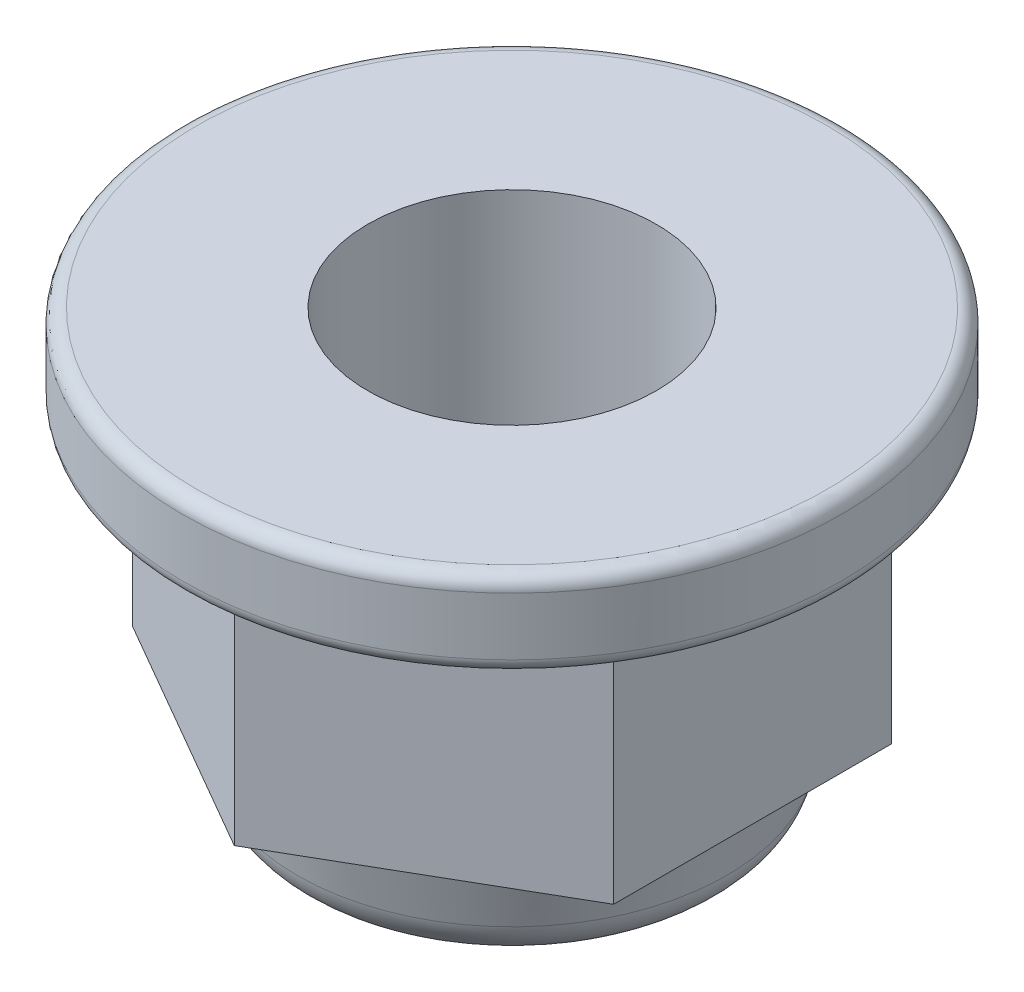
ISO-10303-21;
HEADER;
FILE_DESCRIPTION(('STEP AP214'),'2;1');
FILE_NAME('part.step','',(''),(''),'','','');
FILE_SCHEMA(('AUTOMOTIVE_DESIGN { 1 0 10303 214 1 1 1 1 }'));
ENDSEC;
DATA;
#1=APPLICATION_CONTEXT('core data for automotive mechanical design processes');
#2=APPLICATION_PROTOCOL_DEFINITION('international standard','automotive_design',2000,#1);
#3=PRODUCT_CONTEXT('',#1,'mechanical');
#4=PRODUCT('Part','Part','',(#3));
#5=PRODUCT_RELATED_PRODUCT_CATEGORY('part','',(#4));
#6=PRODUCT_DEFINITION_FORMATION('','',#4);
#7=PRODUCT_DEFINITION_CONTEXT('part definition',#1,'design');
#8=PRODUCT_DEFINITION('design','',#6,#7);
#9=PRODUCT_DEFINITION_SHAPE('','',#8);
#10=(LENGTH_UNIT() NAMED_UNIT(*) SI_UNIT(.MILLI.,.METRE.));
#11=(NAMED_UNIT(*) PLANE_ANGLE_UNIT() SI_UNIT($,.RADIAN.));
#12=(NAMED_UNIT(*) SI_UNIT($,.STERADIAN.) SOLID_ANGLE_UNIT());
#13=UNCERTAINTY_MEASURE_WITH_UNIT(LENGTH_MEASURE(1.E-05),#10,'distance_accuracy_value','');
#14=(GEOMETRIC_REPRESENTATION_CONTEXT(3) GLOBAL_UNCERTAINTY_ASSIGNED_CONTEXT((#13)) GLOBAL_UNIT_ASSIGNED_CONTEXT((#10,
#11,#12)) REPRESENTATION_CONTEXT('',''));
#15=CARTESIAN_POINT('',(0.,0.,0.));
#16=DIRECTION('',(0.,0.,1.));
#17=DIRECTION('',(1.,0.,0.));
#18=AXIS2_PLACEMENT_3D('',#15,#16,#17);
#19=CARTESIAN_POINT('',(0.,0.,-5.77350269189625));
#20=DIRECTION('',(0.,1.,0.));
#21=DIRECTION('',(-1.,0.,0.));
#22=AXIS2_PLACEMENT_3D('',#19,#20,#21);
#23=PLANE('',#22);
#24=DIRECTION('',(0.,0.,1.));
#25=VECTOR('',#24,1.);
#26=CARTESIAN_POINT('',(4.99999999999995,0.,2.88675134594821));
#27=LINE('',#26,#25);
#28=CARTESIAN_POINT('',(4.99999999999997,0.,-2.88675134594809));
#29=VERTEX_POINT('',#28);
#30=CARTESIAN_POINT('',(4.99999999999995,0.,2.88675134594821));
#31=VERTEX_POINT('',#30);
#32=EDGE_CURVE('E100',#29,#31,#27,.T.);
#33=ORIENTED_EDGE('',*,*,#32,.T.);
#34=DIRECTION('',(-0.866025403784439,0.,0.5));
#35=VECTOR('',#34,1.);
#36=CARTESIAN_POINT('',(0.,0.,5.77350269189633));
#37=LINE('',#36,#35);
#38=CARTESIAN_POINT('',(0.,0.,5.77350269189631));
#39=VERTEX_POINT('',#38);
#40=EDGE_CURVE('E106',#31,#39,#37,.T.);
#41=ORIENTED_EDGE('',*,*,#40,.T.);
#42=DIRECTION('',(-0.866025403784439,0.,-0.5));
#43=VECTOR('',#42,1.);
#44=CARTESIAN_POINT('',(-5.,0.,2.88675134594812));
#45=LINE('',#44,#43);
#46=CARTESIAN_POINT('',(-5.00000000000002,0.,2.88675134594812));
#47=VERTEX_POINT('',#46);
#48=EDGE_CURVE('E178',#39,#47,#45,.T.);
#49=ORIENTED_EDGE('',*,*,#48,.T.);
#50=DIRECTION('',(0.,0.,-1.));
#51=VECTOR('',#50,1.);
#52=CARTESIAN_POINT('',(-5.00000000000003,0.,-2.88675134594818));
#53=LINE('',#52,#51);
#54=CARTESIAN_POINT('',(-5.00000000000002,0.,-2.88675134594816));
#55=VERTEX_POINT('',#54);
#56=EDGE_CURVE('E173',#47,#55,#53,.T.);
#57=ORIENTED_EDGE('',*,*,#56,.T.);
#58=DIRECTION('',(0.866025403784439,0.,-0.499999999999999));
#59=VECTOR('',#58,1.);
#60=CARTESIAN_POINT('',(0.,0.,-5.77350269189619));
#61=LINE('',#60,#59);
#62=CARTESIAN_POINT('',(0.,0.,-5.77350269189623));
#63=VERTEX_POINT('',#62);
#64=EDGE_CURVE('E168',#55,#63,#61,.T.);
#65=ORIENTED_EDGE('',*,*,#64,.T.);
#66=DIRECTION('',(0.866025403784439,0.,0.5));
#67=VECTOR('',#66,1.);
#68=CARTESIAN_POINT('',(4.99999999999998,0.,-2.88675134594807));
#69=LINE('',#68,#67);
#70=EDGE_CURVE('E163',#63,#29,#69,.T.);
#71=ORIENTED_EDGE('',*,*,#70,.T.);
#72=EDGE_LOOP('',(#33,#41,#49,#57,#65,#71));
#73=FACE_BOUND('',#72,.T.);
#74=CARTESIAN_POINT('',(0.,0.,0.));
#75=DIRECTION('',(0.,-1.,0.));
#76=DIRECTION('',(0.,0.,1.));
#77=AXIS2_PLACEMENT_3D('',#74,#75,#76);
#78=CIRCLE('',#77,4.86396078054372);
#79=CARTESIAN_POINT('',(0.,0.,-4.86396078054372));
#80=VERTEX_POINT('',#79);
#81=CARTESIAN_POINT('',(0.,0.,4.86396078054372));
#82=VERTEX_POINT('',#81);
#83=EDGE_CURVE('E98',#80,#82,#78,.F.);
#84=ORIENTED_EDGE('',*,*,#83,.T.);
#85=CARTESIAN_POINT('',(0.,0.,0.));
#86=DIRECTION('',(0.,-1.,0.));
#87=DIRECTION('',(0.,0.,-1.));
#88=AXIS2_PLACEMENT_3D('',#85,#86,#87);
#89=CIRCLE('',#88,4.86396078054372);
#90=EDGE_CURVE('E93',#82,#80,#89,.F.);
#91=ORIENTED_EDGE('',*,*,#90,.T.);
#92=EDGE_LOOP('',(#84,#91));
#93=FACE_BOUND('',#92,.T.);
#94=ADVANCED_FACE('F17',(#73,#93),#23,.F.);
#95=CARTESIAN_POINT('',(0.,5.,5.77350269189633));
#96=DIRECTION('',(-0.5,0.,-0.866025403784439));
#97=DIRECTION('',(-0.866025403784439,0.,0.5));
#98=AXIS2_PLACEMENT_3D('',#95,#96,#97);
#99=PLANE('',#98);
#100=DIRECTION('',(0.,1.,0.));
#101=VECTOR('',#100,1.);
#102=CARTESIAN_POINT('',(4.99999999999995,5.,2.88675134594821));
#103=LINE('',#102,#101);
#104=CARTESIAN_POINT('',(4.99999999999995,5.,2.8867513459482));
#105=VERTEX_POINT('',#104);
#106=EDGE_CURVE('E161',#31,#105,#103,.T.);
#107=ORIENTED_EDGE('',*,*,#106,.T.);
#108=DIRECTION('',(-0.866025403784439,0.,0.499999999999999));
#109=VECTOR('',#108,1.);
#110=CARTESIAN_POINT('',(4.99999999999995,5.,2.88675134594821));
#111=LINE('',#110,#109);
#112=CARTESIAN_POINT('',(0.,5.,5.77350269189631));
#113=VERTEX_POINT('',#112);
#114=EDGE_CURVE('E103',#105,#113,#111,.T.);
#115=ORIENTED_EDGE('',*,*,#114,.T.);
#116=DIRECTION('',(0.,1.,0.));
#117=VECTOR('',#116,1.);
#118=CARTESIAN_POINT('',(0.,5.,5.77350269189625));
#119=LINE('',#118,#117);
#120=EDGE_CURVE('E179',#113,#39,#119,.F.);
#121=ORIENTED_EDGE('',*,*,#120,.T.);
#122=ORIENTED_EDGE('',*,*,#40,.F.);
#123=EDGE_LOOP('',(#107,#115,#121,#122));
#124=FACE_BOUND('',#123,.T.);
#125=ADVANCED_FACE('F187',(#124),#99,.F.);
#126=CARTESIAN_POINT('',(-5.,5.,2.88675134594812));
#127=DIRECTION('',(0.5,0.,-0.866025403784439));
#128=DIRECTION('',(-0.866025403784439,0.,-0.5));
#129=AXIS2_PLACEMENT_3D('',#126,#127,#128);
#130=PLANE('',#129);
#131=ORIENTED_EDGE('',*,*,#120,.F.);
#132=DIRECTION('',(-0.86602540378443,0.,-0.500000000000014));
#133=VECTOR('',#132,1.);
#134=CARTESIAN_POINT('',(0.,5.,5.77350269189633));
#135=LINE('',#134,#133);
#136=CARTESIAN_POINT('',(-5.00000000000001,5.,2.88675134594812));
#137=VERTEX_POINT('',#136);
#138=EDGE_CURVE('E200',#113,#137,#135,.T.);
#139=ORIENTED_EDGE('',*,*,#138,.T.);
#140=DIRECTION('',(0.,1.,0.));
#141=VECTOR('',#140,1.);
#142=CARTESIAN_POINT('',(-5.00000000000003,5.,2.88675134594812));
#143=LINE('',#142,#141);
#144=EDGE_CURVE('E175',#137,#47,#143,.F.);
#145=ORIENTED_EDGE('',*,*,#144,.T.);
#146=ORIENTED_EDGE('',*,*,#48,.F.);
#147=EDGE_LOOP('',(#131,#139,#145,#146));
#148=FACE_BOUND('',#147,.T.);
#149=ADVANCED_FACE('F424',(#148),#130,.F.);
#150=CARTESIAN_POINT('',(-5.00000000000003,5.,-2.88675134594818));
#151=DIRECTION('',(1.,0.,0.));
#152=DIRECTION('',(0.,0.,-1.));
#153=AXIS2_PLACEMENT_3D('',#150,#151,#152);
#154=PLANE('',#153);
#155=ORIENTED_EDGE('',*,*,#144,.F.);
#156=DIRECTION('',(0.,0.,1.));
#157=VECTOR('',#156,1.);
#158=CARTESIAN_POINT('',(-5.,5.,0.));
#159=LINE('',#158,#157);
#160=CARTESIAN_POINT('',(-5.00000000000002,5.,-2.88675134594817));
#161=VERTEX_POINT('',#160);
#162=EDGE_CURVE('E202',#137,#161,#159,.F.);
#163=ORIENTED_EDGE('',*,*,#162,.T.);
#164=DIRECTION('',(0.,1.,0.));
#165=VECTOR('',#164,1.);
#166=CARTESIAN_POINT('',(-5.,5.,-2.88675134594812));
#167=LINE('',#166,#165);
#168=EDGE_CURVE('E170',#161,#55,#167,.F.);
#169=ORIENTED_EDGE('',*,*,#168,.T.);
#170=ORIENTED_EDGE('',*,*,#56,.F.);
#171=EDGE_LOOP('',(#155,#163,#169,#170));
#172=FACE_BOUND('',#171,.T.);
#173=ADVANCED_FACE('F246',(#172),#154,.F.);
#174=CARTESIAN_POINT('',(0.,5.,-5.77350269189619));
#175=DIRECTION('',(0.499999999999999,0.,0.866025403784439));
#176=DIRECTION('',(0.866025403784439,0.,-0.499999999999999));
#177=AXIS2_PLACEMENT_3D('',#174,#175,#176);
#178=PLANE('',#177);
#179=ORIENTED_EDGE('',*,*,#168,.F.);
#180=DIRECTION('',(0.866025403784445,0.,-0.499999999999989));
#181=VECTOR('',#180,1.);
#182=CARTESIAN_POINT('',(-5.00000000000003,5.,-2.88675134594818));
#183=LINE('',#182,#181);
#184=CARTESIAN_POINT('',(0.,5.,-5.77350269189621));
#185=VERTEX_POINT('',#184);
#186=EDGE_CURVE('E242',#161,#185,#183,.T.);
#187=ORIENTED_EDGE('',*,*,#186,.T.);
#188=DIRECTION('',(0.,1.,0.));
#189=VECTOR('',#188,1.);
#190=CARTESIAN_POINT('',(0.,5.,-5.77350269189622));
#191=LINE('',#190,#189);
#192=EDGE_CURVE('E165',#185,#63,#191,.F.);
#193=ORIENTED_EDGE('',*,*,#192,.T.);
#194=ORIENTED_EDGE('',*,*,#64,.F.);
#195=EDGE_LOOP('',(#179,#187,#193,#194));
#196=FACE_BOUND('',#195,.T.);
#197=ADVANCED_FACE('F251',(#196),#178,.F.);
#198=CARTESIAN_POINT('',(4.99999999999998,5.,-2.88675134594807));
#199=DIRECTION('',(-0.5,0.,0.866025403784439));
#200=DIRECTION('',(0.866025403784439,0.,0.5));
#201=AXIS2_PLACEMENT_3D('',#198,#199,#200);
#202=PLANE('',#201);
#203=ORIENTED_EDGE('',*,*,#192,.F.);
#204=DIRECTION('',(0.866025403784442,0.,0.499999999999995));
#205=VECTOR('',#204,1.);
#206=CARTESIAN_POINT('',(0.,5.,-5.77350269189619));
#207=LINE('',#206,#205);
#208=CARTESIAN_POINT('',(4.99999999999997,5.,-2.88675134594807));
#209=VERTEX_POINT('',#208);
#210=EDGE_CURVE('E195',#185,#209,#207,.T.);
#211=ORIENTED_EDGE('',*,*,#210,.T.);
#212=DIRECTION('',(0.,1.,0.));
#213=VECTOR('',#212,1.);
#214=CARTESIAN_POINT('',(4.99999999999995,5.,-2.88675134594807));
#215=LINE('',#214,#213);
#216=EDGE_CURVE('E158',#209,#29,#215,.F.);
#217=ORIENTED_EDGE('',*,*,#216,.T.);
#218=ORIENTED_EDGE('',*,*,#70,.F.);
#219=EDGE_LOOP('',(#203,#211,#217,#218));
#220=FACE_BOUND('',#219,.T.);
#221=ADVANCED_FACE('F254',(#220),#202,.F.);
#222=CARTESIAN_POINT('',(4.99999999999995,5.,2.88675134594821));
#223=DIRECTION('',(-1.,0.,0.));
#224=DIRECTION('',(0.,0.,1.));
#225=AXIS2_PLACEMENT_3D('',#222,#223,#224);
#226=PLANE('',#225);
#227=ORIENTED_EDGE('',*,*,#216,.F.);
#228=DIRECTION('',(0.,0.,1.));
#229=VECTOR('',#228,1.);
#230=CARTESIAN_POINT('',(4.99999999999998,5.,0.));
#231=LINE('',#230,#229);
#232=EDGE_CURVE('E155',#209,#105,#231,.T.);
#233=ORIENTED_EDGE('',*,*,#232,.T.);
#234=ORIENTED_EDGE('',*,*,#106,.F.);
#235=ORIENTED_EDGE('',*,*,#32,.F.);
#236=EDGE_LOOP('',(#227,#233,#234,#235));
#237=FACE_BOUND('',#236,.T.);
#238=ADVANCED_FACE('F138',(#237),#226,.F.);
#239=CARTESIAN_POINT('',(0.,-0.200000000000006,0.));
#240=DIRECTION('',(0.,1.,0.));
#241=DIRECTION('',(0.,0.,1.));
#242=AXIS2_PLACEMENT_3D('',#239,#240,#241);
#243=TOROIDAL_SURFACE('',#242,4.86396078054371,0.2);
#244=CARTESIAN_POINT('',(0.,-0.160776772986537,0.));
#245=DIRECTION('',(0.,1.,0.));
#246=DIRECTION('',(0.,0.,1.));
#247=AXIS2_PLACEMENT_3D('',#244,#245,#246);
#248=CIRCLE('',#247,4.66784464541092);
#249=CARTESIAN_POINT('',(0.,-0.160776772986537,4.66784464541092));
#250=VERTEX_POINT('',#249);
#251=EDGE_CURVE('E151',#250,#250,#248,.F.);
#252=ORIENTED_EDGE('',*,*,#251,.F.);
#253=EDGE_LOOP('',(#252));
#254=FACE_BOUND('',#253,.T.);
#255=ORIENTED_EDGE('',*,*,#83,.F.);
#256=ORIENTED_EDGE('',*,*,#90,.F.);
#257=EDGE_LOOP('',(#255,#256));
#258=FACE_BOUND('',#257,.T.);
#259=ADVANCED_FACE('F97',(#254,#258),#243,.F.);
#260=CARTESIAN_POINT('',(0.,5.,0.));
#261=DIRECTION('',(0.,1.,0.));
#262=DIRECTION('',(-1.,0.,0.));
#263=AXIS2_PLACEMENT_3D('',#260,#261,#262);
#264=PLANE('',#263);
#265=ORIENTED_EDGE('',*,*,#210,.F.);
#266=ORIENTED_EDGE('',*,*,#186,.F.);
#267=ORIENTED_EDGE('',*,*,#162,.F.);
#268=ORIENTED_EDGE('',*,*,#138,.F.);
#269=ORIENTED_EDGE('',*,*,#114,.F.);
#270=ORIENTED_EDGE('',*,*,#232,.F.);
#271=EDGE_LOOP('',(#265,#266,#267,#268,#269,#270));
#272=FACE_BOUND('',#271,.T.);
#273=CARTESIAN_POINT('',(0.,5.,0.));
#274=DIRECTION('',(0.,1.,0.));
#275=DIRECTION('',(0.,0.,1.));
#276=AXIS2_PLACEMENT_3D('',#273,#274,#275);
#277=CIRCLE('',#276,6.55000000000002);
#278=CARTESIAN_POINT('',(0.,5.,6.55000000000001));
#279=VERTEX_POINT('',#278);
#280=CARTESIAN_POINT('',(0.,5.,-6.55));
#281=VERTEX_POINT('',#280);
#282=EDGE_CURVE('E154',#279,#281,#277,.T.);
#283=ORIENTED_EDGE('',*,*,#282,.F.);
#284=CARTESIAN_POINT('',(0.,5.,0.));
#285=DIRECTION('',(0.,1.,0.));
#286=DIRECTION('',(0.,0.,-1.));
#287=AXIS2_PLACEMENT_3D('',#284,#285,#286);
#288=CIRCLE('',#287,6.55);
#289=EDGE_CURVE('E208',#281,#279,#288,.T.);
#290=ORIENTED_EDGE('',*,*,#289,.F.);
#291=EDGE_LOOP('',(#283,#290));
#292=FACE_BOUND('',#291,.T.);
#293=ADVANCED_FACE('F137',(#272,#292),#264,.F.);
#294=CARTESIAN_POINT('',(0.,-0.160776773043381,0.));
#295=DIRECTION('',(0.,1.,0.));
#296=DIRECTION('',(0.,0.,1.));
#297=AXIS2_PLACEMENT_3D('',#294,#295,#296);
#298=CONICAL_SURFACE('',#297,4.66784464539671,0.197395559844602);
#299=CARTESIAN_POINT('',(0.,-1.19611613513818,0.));
#300=DIRECTION('',(0.,-1.,0.));
#301=DIRECTION('',(0.,0.,-1.));
#302=AXIS2_PLACEMENT_3D('',#299,#300,#301);
#303=CIRCLE('',#302,4.46077677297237);
#304=CARTESIAN_POINT('',(0.,-1.19611613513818,-4.46077677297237));
#305=VERTEX_POINT('',#304);
#306=EDGE_CURVE('E213',#305,#305,#303,.T.);
#307=ORIENTED_EDGE('',*,*,#306,.F.);
#308=EDGE_LOOP('',(#307));
#309=FACE_BOUND('',#308,.T.);
#310=ORIENTED_EDGE('',*,*,#251,.T.);
#311=EDGE_LOOP('',(#310));
#312=FACE_BOUND('',#311,.T.);
#313=ADVANCED_FACE('F380',(#309,#312),#298,.T.);
#314=CARTESIAN_POINT('',(0.,5.3,0.));
#315=DIRECTION('',(0.,1.,0.));
#316=DIRECTION('',(0.,0.,1.));
#317=AXIS2_PLACEMENT_3D('',#314,#315,#316);
#318=TOROIDAL_SURFACE('',#317,6.55,0.3);
#319=ORIENTED_EDGE('',*,*,#282,.T.);
#320=ORIENTED_EDGE('',*,*,#289,.T.);
#321=EDGE_LOOP('',(#319,#320));
#322=FACE_BOUND('',#321,.T.);
#323=CARTESIAN_POINT('',(0.,5.3,0.));
#324=DIRECTION('',(0.,-1.,0.));
#325=DIRECTION('',(1.,0.,0.));
#326=AXIS2_PLACEMENT_3D('',#323,#324,#325);
#327=CIRCLE('',#326,6.85000000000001);
#328=CARTESIAN_POINT('',(6.85000000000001,5.3,0.));
#329=VERTEX_POINT('',#328);
#330=EDGE_CURVE('E215',#329,#329,#327,.F.);
#331=ORIENTED_EDGE('',*,*,#330,.F.);
#332=EDGE_LOOP('',(#331));
#333=FACE_BOUND('',#332,.T.);
#334=ADVANCED_FACE('F209',(#322,#333),#318,.T.);
#335=CARTESIAN_POINT('',(0.,-1.,0.));
#336=DIRECTION('',(0.,-1.,0.));
#337=DIRECTION('',(0.,0.,-1.));
#338=AXIS2_PLACEMENT_3D('',#335,#336,#337);
#339=TOROIDAL_SURFACE('',#338,3.48019609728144,1.);
#340=ORIENTED_EDGE('',*,*,#306,.T.);
#341=EDGE_LOOP('',(#340));
#342=FACE_BOUND('',#341,.T.);
#343=CARTESIAN_POINT('',(0.,-2.,0.));
#344=DIRECTION('',(0.,1.,0.));
#345=DIRECTION('',(0.,0.,-1.));
#346=AXIS2_PLACEMENT_3D('',#343,#344,#345);
#347=CIRCLE('',#346,3.48019609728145);
#348=CARTESIAN_POINT('',(0.,-2.,3.48019609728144));
#349=VERTEX_POINT('',#348);
#350=CARTESIAN_POINT('',(0.,-2.,-3.48019609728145));
#351=VERTEX_POINT('',#350);
#352=EDGE_CURVE('E340',#349,#351,#347,.F.);
#353=ORIENTED_EDGE('',*,*,#352,.F.);
#354=CARTESIAN_POINT('',(0.,-2.,0.));
#355=DIRECTION('',(0.,1.,0.));
#356=DIRECTION('',(0.,0.,1.));
#357=AXIS2_PLACEMENT_3D('',#354,#355,#356);
#358=CIRCLE('',#357,3.48019609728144);
#359=EDGE_CURVE('E220',#351,#349,#358,.F.);
#360=ORIENTED_EDGE('',*,*,#359,.F.);
#361=EDGE_LOOP('',(#353,#360));
#362=FACE_BOUND('',#361,.T.);
#363=ADVANCED_FACE('F322',(#342,#362),#339,.T.);
#364=CARTESIAN_POINT('',(0.,6.8,0.));
#365=DIRECTION('',(0.,-1.,0.));
#366=DIRECTION('',(1.,0.,0.));
#367=AXIS2_PLACEMENT_3D('',#364,#365,#366);
#368=CYLINDRICAL_SURFACE('',#367,6.85000000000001);
#369=CARTESIAN_POINT('',(0.,6.50000000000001,0.));
#370=DIRECTION('',(0.,1.,0.));
#371=DIRECTION('',(0.,0.,1.));
#372=AXIS2_PLACEMENT_3D('',#369,#370,#371);
#373=CIRCLE('',#372,6.85);
#374=CARTESIAN_POINT('',(0.,6.50000000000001,6.85));
#375=VERTEX_POINT('',#374);
#376=EDGE_CURVE('E338',#375,#375,#373,.T.);
#377=ORIENTED_EDGE('',*,*,#376,.F.);
#378=EDGE_LOOP('',(#377));
#379=FACE_BOUND('',#378,.T.);
#380=ORIENTED_EDGE('',*,*,#330,.T.);
#381=EDGE_LOOP('',(#380));
#382=FACE_BOUND('',#381,.T.);
#383=ADVANCED_FACE('F331',(#379,#382),#368,.T.);
#384=CARTESIAN_POINT('',(4.3,-2.,0.));
#385=DIRECTION('',(0.,-1.,0.));
#386=DIRECTION('',(1.,0.,0.));
#387=AXIS2_PLACEMENT_3D('',#384,#385,#386);
#388=PLANE('',#387);
#389=ORIENTED_EDGE('',*,*,#359,.T.);
#390=ORIENTED_EDGE('',*,*,#352,.T.);
#391=EDGE_LOOP('',(#389,#390));
#392=FACE_BOUND('',#391,.T.);
#393=CARTESIAN_POINT('',(0.,-2.,0.));
#394=DIRECTION('',(0.,1.,0.));
#395=DIRECTION('',(-1.,0.,0.));
#396=AXIS2_PLACEMENT_3D('',#393,#394,#395);
#397=CIRCLE('',#396,3.00000000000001);
#398=CARTESIAN_POINT('',(-3.00000000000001,-2.,0.));
#399=VERTEX_POINT('',#398);
#400=EDGE_CURVE('E370',#399,#399,#397,.T.);
#401=ORIENTED_EDGE('',*,*,#400,.T.);
#402=EDGE_LOOP('',(#401));
#403=FACE_BOUND('',#402,.T.);
#404=ADVANCED_FACE('F297',(#392,#403),#388,.T.);
#405=CARTESIAN_POINT('',(0.,6.50000000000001,0.));
#406=DIRECTION('',(0.,1.,0.));
#407=DIRECTION('',(0.,0.,1.));
#408=AXIS2_PLACEMENT_3D('',#405,#406,#407);
#409=TOROIDAL_SURFACE('',#408,6.55,0.3);
#410=ORIENTED_EDGE('',*,*,#376,.T.);
#411=EDGE_LOOP('',(#410));
#412=FACE_BOUND('',#411,.T.);
#413=CARTESIAN_POINT('',(0.,6.80000000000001,0.));
#414=DIRECTION('',(0.,-1.,0.));
#415=DIRECTION('',(0.,0.,1.));
#416=AXIS2_PLACEMENT_3D('',#413,#414,#415);
#417=CIRCLE('',#416,6.55000000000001);
#418=CARTESIAN_POINT('',(0.,6.80000000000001,-6.55));
#419=VERTEX_POINT('',#418);
#420=CARTESIAN_POINT('',(0.,6.80000000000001,6.55000000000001));
#421=VERTEX_POINT('',#420);
#422=EDGE_CURVE('E29',#419,#421,#417,.F.);
#423=ORIENTED_EDGE('',*,*,#422,.F.);
#424=CARTESIAN_POINT('',(0.,6.80000000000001,0.));
#425=DIRECTION('',(0.,-1.,0.));
#426=DIRECTION('',(0.,0.,-1.));
#427=AXIS2_PLACEMENT_3D('',#424,#425,#426);
#428=CIRCLE('',#427,6.55);
#429=EDGE_CURVE('E372',#421,#419,#428,.F.);
#430=ORIENTED_EDGE('',*,*,#429,.F.);
#431=EDGE_LOOP('',(#423,#430));
#432=FACE_BOUND('',#431,.T.);
#433=ADVANCED_FACE('F271',(#412,#432),#409,.T.);
#434=CARTESIAN_POINT('',(0.,-2.,0.));
#435=DIRECTION('',(0.,1.,0.));
#436=DIRECTION('',(-1.,0.,0.));
#437=AXIS2_PLACEMENT_3D('',#434,#435,#436);
#438=CYLINDRICAL_SURFACE('',#437,3.00000000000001);
#439=CARTESIAN_POINT('',(0.,6.8,0.));
#440=DIRECTION('',(0.,1.,0.));
#441=DIRECTION('',(-1.,0.,0.));
#442=AXIS2_PLACEMENT_3D('',#439,#440,#441);
#443=CIRCLE('',#442,3.00000000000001);
#444=CARTESIAN_POINT('',(-3.00000000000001,6.8,0.));
#445=VERTEX_POINT('',#444);
#446=EDGE_CURVE('E11',#445,#445,#443,.F.);
#447=ORIENTED_EDGE('',*,*,#446,.F.);
#448=EDGE_LOOP('',(#447));
#449=FACE_BOUND('',#448,.T.);
#450=ORIENTED_EDGE('',*,*,#400,.F.);
#451=EDGE_LOOP('',(#450));
#452=FACE_BOUND('',#451,.T.);
#453=ADVANCED_FACE('F265',(#449,#452),#438,.F.);
#454=CARTESIAN_POINT('',(0.,6.8,0.));
#455=DIRECTION('',(0.,1.,0.));
#456=DIRECTION('',(-1.,0.,0.));
#457=AXIS2_PLACEMENT_3D('',#454,#455,#456);
#458=PLANE('',#457);
#459=ORIENTED_EDGE('',*,*,#446,.T.);
#460=EDGE_LOOP('',(#459));
#461=FACE_BOUND('',#460,.T.);
#462=ORIENTED_EDGE('',*,*,#429,.T.);
#463=ORIENTED_EDGE('',*,*,#422,.T.);
#464=EDGE_LOOP('',(#462,#463));
#465=FACE_BOUND('',#464,.T.);
#466=ADVANCED_FACE('F263',(#461,#465),#458,.T.);
#467=CLOSED_SHELL('',(#94,#125,#149,#173,#197,#221,#238,#259,#293,#313,#334,#363,#383,#404,#433,
#453,#466));
#468=MANIFOLD_SOLID_BREP('B1',#467);
#469=ADVANCED_BREP_SHAPE_REPRESENTATION('',(#18,#468),#14);
#470=SHAPE_DEFINITION_REPRESENTATION(#9,#469);
ENDSEC;
END-ISO-10303-21;
